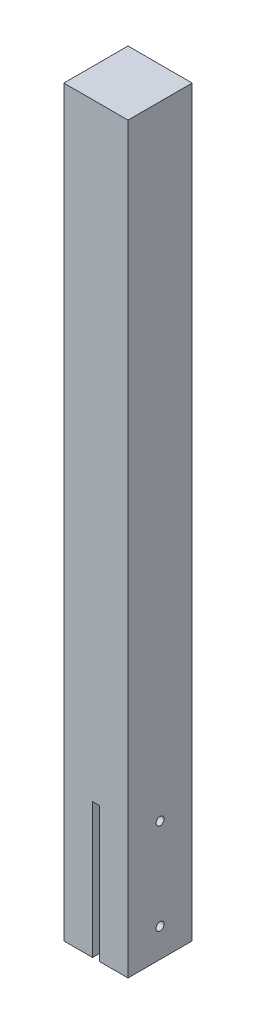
from build123d import *

# Parameters (mm, degrees)
SKETCH2_W                                   = 95
SKETCH2_H                                   = 95
EXTRUDE_H_JD_DEPTH                          = 1100
SKETCH10_W                                  = 10
SKETCH10_H                                  = 95
CUT_SLITS_F_R_STOLPFOT_DEPTH                = 200
CUT_SKRUVH_L_F_R_STOLPFOT_REACH             = 1201.383
SKETCH8_R                                   = 6
CUT_SKRUVH_L_F_R_STOLPFOT_DIRECTION_2_REACH = 1201.383


with BuildPart() as part:
    # Sketch2 → Extrude h_jd (new body)
    with BuildSketch(Plane(origin=(0, 0, 0), x_dir=(1, 0, 0), z_dir=(0, 1, 0))):
        Rectangle(SKETCH2_W, SKETCH2_H)
    extrude(amount=EXTRUDE_H_JD_DEPTH)

    # Sketch10 → Cut-slits f_r stolpfot (cut)
    with BuildSketch(Plane(origin=(0, 0, 0), x_dir=(-1, 0, 0), z_dir=(0, -1, 0))):
        Rectangle(SKETCH10_W, SKETCH10_H)
    extrude(amount=-CUT_SLITS_F_R_STOLPFOT_DEPTH, mode=Mode.SUBTRACT)

    # Sketch8 → Cut-skruvh_l f_r stolpfot (cut, up to next)
    with BuildSketch(Plane(origin=(0, -97.5, 0), x_dir=(0, 1, 0), z_dir=(-1, 0, 0)), mode=Mode.PRIVATE) as cut_skruvh_l_f_r_stolpfot_sk1:
        with Locations(Location((275, 0, 0), (0, 0, 270))):
            Circle(SKETCH8_R)
    cut_skruvh_l_f_r_stolpfot_tool1 = extrude(cut_skruvh_l_f_r_stolpfot_sk1.sketch, amount=CUT_SKRUVH_L_F_R_STOLPFOT_REACH, mode=Mode.PRIVATE) & part.part
    # Sketch8 → Cut-skruvh_l f_r stolpfot (cut, up to next)
    with BuildSketch(Plane(origin=(0, -97.5, 0), x_dir=(0, 1, 0), z_dir=(-1, 0, 0)), mode=Mode.PRIVATE) as cut_skruvh_l_f_r_stolpfot_sk2:
        with Locations(Location((140, 0, 0), (0, 0, 270))):
            Circle(SKETCH8_R)
    cut_skruvh_l_f_r_stolpfot_tool2 = extrude(cut_skruvh_l_f_r_stolpfot_sk2.sketch, amount=CUT_SKRUVH_L_F_R_STOLPFOT_REACH, mode=Mode.PRIVATE) & part.part
    add(cut_skruvh_l_f_r_stolpfot_tool1.solids().sort_by_distance((0, 177.5, 0))[0], mode=Mode.SUBTRACT)
    add(cut_skruvh_l_f_r_stolpfot_tool2.solids().sort_by_distance((0, 42.5, 0))[0], mode=Mode.SUBTRACT)

    # Sketch8 → Cut-skruvh_l f_r stolpfot direction 2 (cut, up to next)
    with BuildSketch(Plane(origin=(0, -97.5, 0), x_dir=(0, 1, 0), z_dir=(-1, 0, 0)), mode=Mode.PRIVATE) as cut_skruvh_l_f_r_stolpfot_direction_2_sk1:
        with Locations(Location((275, 0, 0), (0, 0, 270))):
            Circle(SKETCH8_R)
    cut_skruvh_l_f_r_stolpfot_direction_2_tool1 = extrude(cut_skruvh_l_f_r_stolpfot_direction_2_sk1.sketch, amount=-CUT_SKRUVH_L_F_R_STOLPFOT_DIRECTION_2_REACH, mode=Mode.PRIVATE) & part.part
    # Sketch8 → Cut-skruvh_l f_r stolpfot direction 2 (cut, up to next)
    with BuildSketch(Plane(origin=(0, -97.5, 0), x_dir=(0, 1, 0), z_dir=(-1, 0, 0)), mode=Mode.PRIVATE) as cut_skruvh_l_f_r_stolpfot_direction_2_sk2:
        with Locations(Location((140, 0, 0), (0, 0, 270))):
            Circle(SKETCH8_R)
    cut_skruvh_l_f_r_stolpfot_direction_2_tool2 = extrude(cut_skruvh_l_f_r_stolpfot_direction_2_sk2.sketch, amount=-CUT_SKRUVH_L_F_R_STOLPFOT_DIRECTION_2_REACH, mode=Mode.PRIVATE) & part.part
    add(cut_skruvh_l_f_r_stolpfot_direction_2_tool1.solids().sort_by_distance((0, 177.5, 0))[0], mode=Mode.SUBTRACT)
    add(cut_skruvh_l_f_r_stolpfot_direction_2_tool2.solids().sort_by_distance((0, 42.5, 0))[0], mode=Mode.SUBTRACT)


solid = part.part
